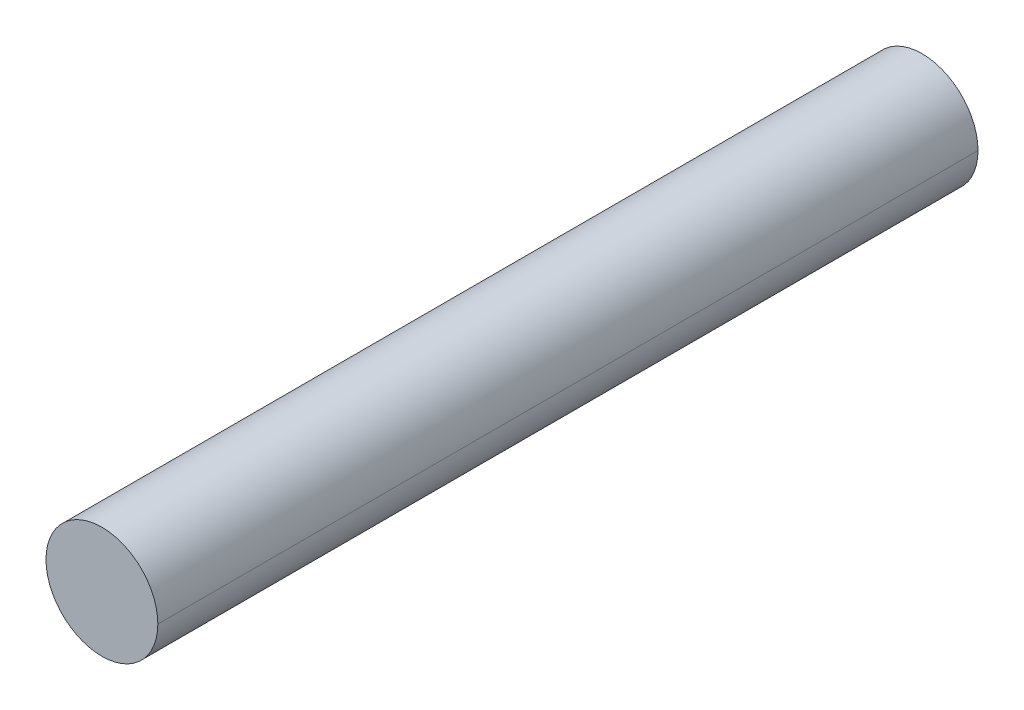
ISO-10303-21;
HEADER;
FILE_DESCRIPTION(('STEP AP214'),'2;1');
FILE_NAME('part.step','',(''),(''),'','','');
FILE_SCHEMA(('AUTOMOTIVE_DESIGN { 1 0 10303 214 1 1 1 1 }'));
ENDSEC;
DATA;
#1=APPLICATION_CONTEXT('core data for automotive mechanical design processes');
#2=APPLICATION_PROTOCOL_DEFINITION('international standard','automotive_design',2000,#1);
#3=PRODUCT_CONTEXT('',#1,'mechanical');
#4=PRODUCT('Part','Part','',(#3));
#5=PRODUCT_RELATED_PRODUCT_CATEGORY('part','',(#4));
#6=PRODUCT_DEFINITION_FORMATION('','',#4);
#7=PRODUCT_DEFINITION_CONTEXT('part definition',#1,'design');
#8=PRODUCT_DEFINITION('design','',#6,#7);
#9=PRODUCT_DEFINITION_SHAPE('','',#8);
#10=(LENGTH_UNIT() NAMED_UNIT(*) SI_UNIT(.MILLI.,.METRE.));
#11=(NAMED_UNIT(*) PLANE_ANGLE_UNIT() SI_UNIT($,.RADIAN.));
#12=(NAMED_UNIT(*) SI_UNIT($,.STERADIAN.) SOLID_ANGLE_UNIT());
#13=UNCERTAINTY_MEASURE_WITH_UNIT(LENGTH_MEASURE(1.E-05),#10,'distance_accuracy_value','');
#14=(GEOMETRIC_REPRESENTATION_CONTEXT(3) GLOBAL_UNCERTAINTY_ASSIGNED_CONTEXT((#13)) GLOBAL_UNIT_ASSIGNED_CONTEXT((#10,
#11,#12)) REPRESENTATION_CONTEXT('',''));
#15=CARTESIAN_POINT('',(0.,0.,0.));
#16=DIRECTION('',(0.,0.,1.));
#17=DIRECTION('',(1.,0.,0.));
#18=AXIS2_PLACEMENT_3D('',#15,#16,#17);
#19=CARTESIAN_POINT('',(0.,0.,-152.4));
#20=DIRECTION('',(0.,0.,1.));
#21=DIRECTION('',(1.,0.,0.));
#22=AXIS2_PLACEMENT_3D('',#19,#20,#21);
#23=CYLINDRICAL_SURFACE('',#22,19.05);
#24=DIRECTION('',(0.,0.,1.));
#25=VECTOR('',#24,1.);
#26=CARTESIAN_POINT('',(-19.05,1.30641350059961E-13,-152.4));
#27=LINE('',#26,#25);
#28=CARTESIAN_POINT('',(-19.05,1.30641350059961E-13,127.));
#29=VERTEX_POINT('',#28);
#30=CARTESIAN_POINT('',(-19.05,0.,-152.4));
#31=VERTEX_POINT('',#30);
#32=EDGE_CURVE('E61',#29,#31,#27,.F.);
#33=ORIENTED_EDGE('',*,*,#32,.F.);
#34=CARTESIAN_POINT('',(0.,0.,127.));
#35=DIRECTION('',(0.,0.,1.));
#36=DIRECTION('',(1.,0.,0.));
#37=AXIS2_PLACEMENT_3D('',#34,#35,#36);
#38=CIRCLE('',#37,19.05);
#39=CARTESIAN_POINT('',(19.05,0.,127.));
#40=VERTEX_POINT('',#39);
#41=EDGE_CURVE('E53',#40,#29,#38,.T.);
#42=ORIENTED_EDGE('',*,*,#41,.F.);
#43=DIRECTION('',(0.,0.,1.));
#44=VECTOR('',#43,1.);
#45=CARTESIAN_POINT('',(19.05,0.,-152.4));
#46=LINE('',#45,#44);
#47=CARTESIAN_POINT('',(19.05,0.,-152.4));
#48=VERTEX_POINT('',#47);
#49=EDGE_CURVE('E70',#48,#40,#46,.T.);
#50=ORIENTED_EDGE('',*,*,#49,.F.);
#51=CARTESIAN_POINT('',(0.,0.,-152.4));
#52=DIRECTION('',(0.,0.,1.));
#53=DIRECTION('',(1.,0.,0.));
#54=AXIS2_PLACEMENT_3D('',#51,#52,#53);
#55=CIRCLE('',#54,19.05);
#56=EDGE_CURVE('E72',#48,#31,#55,.T.);
#57=ORIENTED_EDGE('',*,*,#56,.T.);
#58=EDGE_LOOP('',(#33,#42,#50,#57));
#59=FACE_BOUND('',#58,.T.);
#60=ADVANCED_FACE('F40',(#59),#23,.T.);
#61=CARTESIAN_POINT('',(0.,0.,-152.4));
#62=DIRECTION('',(0.,0.,1.));
#63=DIRECTION('',(1.,0.,0.));
#64=AXIS2_PLACEMENT_3D('',#61,#62,#63);
#65=CYLINDRICAL_SURFACE('',#64,19.05);
#66=ORIENTED_EDGE('',*,*,#49,.T.);
#67=CARTESIAN_POINT('',(0.,0.,127.));
#68=DIRECTION('',(0.,0.,1.));
#69=DIRECTION('',(1.,0.,0.));
#70=AXIS2_PLACEMENT_3D('',#67,#68,#69);
#71=CIRCLE('',#70,19.05);
#72=EDGE_CURVE('E11',#40,#29,#71,.F.);
#73=ORIENTED_EDGE('',*,*,#72,.T.);
#74=ORIENTED_EDGE('',*,*,#32,.T.);
#75=CARTESIAN_POINT('',(0.,0.,-152.4));
#76=DIRECTION('',(0.,0.,1.));
#77=DIRECTION('',(1.,0.,0.));
#78=AXIS2_PLACEMENT_3D('',#75,#76,#77);
#79=CIRCLE('',#78,19.05);
#80=EDGE_CURVE('E47',#31,#48,#79,.T.);
#81=ORIENTED_EDGE('',*,*,#80,.T.);
#82=EDGE_LOOP('',(#66,#73,#74,#81));
#83=FACE_BOUND('',#82,.T.);
#84=ADVANCED_FACE('F74',(#83),#65,.T.);
#85=CARTESIAN_POINT('',(0.,0.,-152.4));
#86=DIRECTION('',(0.,0.,1.));
#87=DIRECTION('',(1.,0.,0.));
#88=AXIS2_PLACEMENT_3D('',#85,#86,#87);
#89=PLANE('',#88);
#90=ORIENTED_EDGE('',*,*,#80,.F.);
#91=ORIENTED_EDGE('',*,*,#56,.F.);
#92=EDGE_LOOP('',(#90,#91));
#93=FACE_BOUND('',#92,.T.);
#94=ADVANCED_FACE('F84',(#93),#89,.F.);
#95=CARTESIAN_POINT('',(0.,0.,127.));
#96=DIRECTION('',(0.,0.,1.));
#97=DIRECTION('',(1.,0.,0.));
#98=AXIS2_PLACEMENT_3D('',#95,#96,#97);
#99=PLANE('',#98);
#100=ORIENTED_EDGE('',*,*,#41,.T.);
#101=ORIENTED_EDGE('',*,*,#72,.F.);
#102=EDGE_LOOP('',(#100,#101));
#103=FACE_BOUND('',#102,.T.);
#104=ADVANCED_FACE('F67',(#103),#99,.T.);
#105=CLOSED_SHELL('',(#60,#84,#94,#104));
#106=MANIFOLD_SOLID_BREP('B2',#105);
#107=ADVANCED_BREP_SHAPE_REPRESENTATION('',(#18,#106),#14);
#108=SHAPE_DEFINITION_REPRESENTATION(#9,#107);
ENDSEC;
END-ISO-10303-21;
